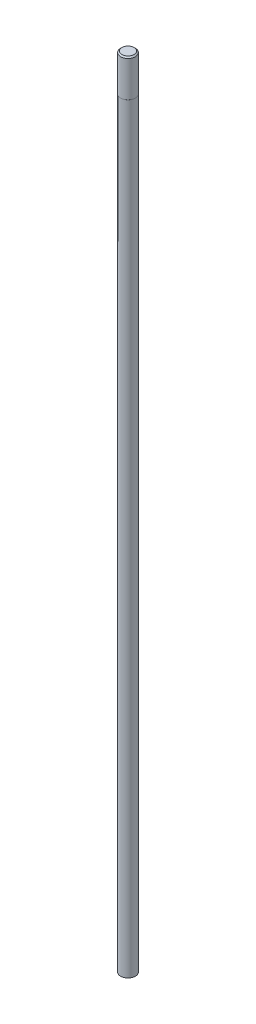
from build123d import *

# Parameters (mm, degrees)
SKETCH1_R      = 2
EXTRUDE1_DEPTH = 205
SKETCH2_R      = 1.99
EXTRUDE2_DEPTH = 10
CHAMFER1_SIZE  = 0.35


with BuildPart() as part:
    # Sketch1 → Extrude1 (new body)
    with BuildSketch(Plane(origin=(0, 0, 0), x_dir=(1, 0, 0), z_dir=(0, 1, 0))):
        with Locations(Location((0, 0, 0), (0, 0, 90))):
            Circle(SKETCH1_R)
    extrude(amount=EXTRUDE1_DEPTH)

    # Sketch2 → Extrude2 (add)
    with BuildSketch(Plane(origin=(0, 205, 0), x_dir=(-1, 0, 0), z_dir=(0, 1, 0))):
        with Locations(Location((0, 0, 0), (0, 0, 90))):
            Circle(SKETCH2_R)
    extrude(amount=EXTRUDE2_DEPTH)

    # Chamfer1
    chamfer1_edges = [part.edges().sort_by_distance(p)[0] for p in [
        (0, 215, -1.99),
    ]]
    chamfer(chamfer1_edges, length=CHAMFER1_SIZE)


solid = part.part
